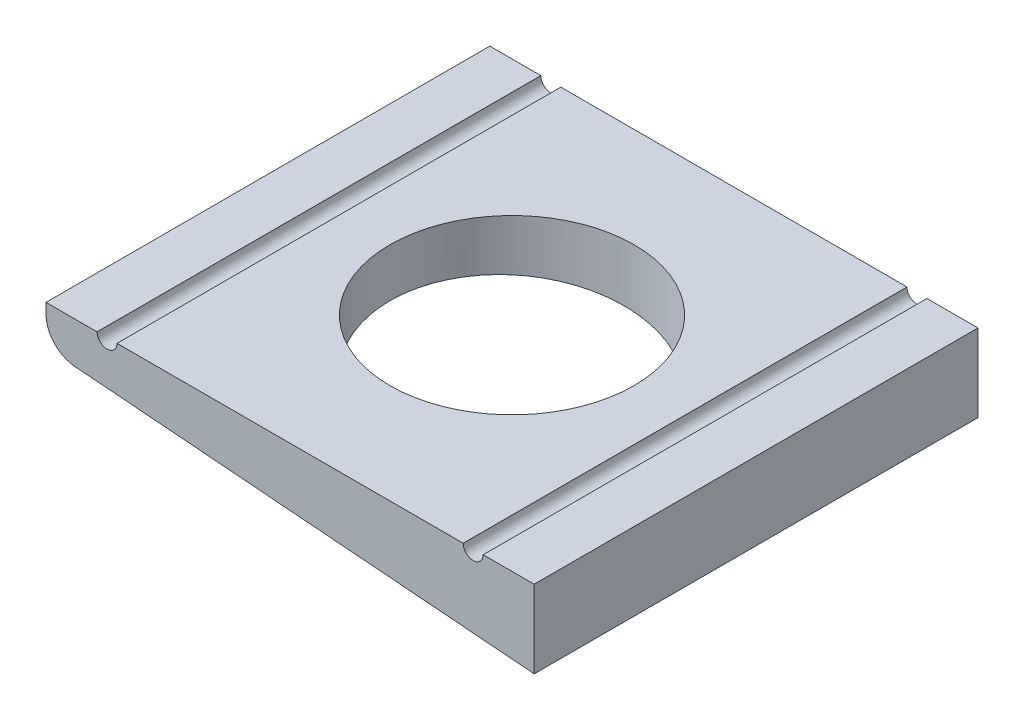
ISO-10303-21;
HEADER;
FILE_DESCRIPTION(('STEP AP214'),'2;1');
FILE_NAME('part.step','',(''),(''),'','','');
FILE_SCHEMA(('AUTOMOTIVE_DESIGN { 1 0 10303 214 1 1 1 1 }'));
ENDSEC;
DATA;
#1=APPLICATION_CONTEXT('core data for automotive mechanical design processes');
#2=APPLICATION_PROTOCOL_DEFINITION('international standard','automotive_design',2000,#1);
#3=PRODUCT_CONTEXT('',#1,'mechanical');
#4=PRODUCT('Part','Part','',(#3));
#5=PRODUCT_RELATED_PRODUCT_CATEGORY('part','',(#4));
#6=PRODUCT_DEFINITION_FORMATION('','',#4);
#7=PRODUCT_DEFINITION_CONTEXT('part definition',#1,'design');
#8=PRODUCT_DEFINITION('design','',#6,#7);
#9=PRODUCT_DEFINITION_SHAPE('','',#8);
#10=(LENGTH_UNIT() NAMED_UNIT(*) SI_UNIT(.MILLI.,.METRE.));
#11=(NAMED_UNIT(*) PLANE_ANGLE_UNIT() SI_UNIT($,.RADIAN.));
#12=(NAMED_UNIT(*) SI_UNIT($,.STERADIAN.) SOLID_ANGLE_UNIT());
#13=UNCERTAINTY_MEASURE_WITH_UNIT(LENGTH_MEASURE(1.E-05),#10,'distance_accuracy_value','');
#14=(GEOMETRIC_REPRESENTATION_CONTEXT(3) GLOBAL_UNCERTAINTY_ASSIGNED_CONTEXT((#13)) GLOBAL_UNIT_ASSIGNED_CONTEXT((#10,
#11,#12)) REPRESENTATION_CONTEXT('',''));
#15=CARTESIAN_POINT('',(0.,0.,0.));
#16=DIRECTION('',(0.,0.,1.));
#17=DIRECTION('',(1.,0.,0.));
#18=AXIS2_PLACEMENT_3D('',#15,#16,#17);
#19=CARTESIAN_POINT('',(22.,0.,20.));
#20=DIRECTION('',(0.,-1.,0.));
#21=DIRECTION('',(1.,0.,0.));
#22=AXIS2_PLACEMENT_3D('',#19,#20,#21);
#23=PLANE('',#22);
#24=CARTESIAN_POINT('',(0.,0.,0.));
#25=DIRECTION('',(0.,1.,0.));
#26=DIRECTION('',(-1.,0.,0.));
#27=AXIS2_PLACEMENT_3D('',#24,#25,#26);
#28=CIRCLE('',#27,11.);
#29=CARTESIAN_POINT('',(-11.,0.,0.));
#30=VERTEX_POINT('',#29);
#31=EDGE_CURVE('E155',#30,#30,#28,.T.);
#32=ORIENTED_EDGE('',*,*,#31,.F.);
#33=EDGE_LOOP('',(#32));
#34=FACE_BOUND('',#33,.T.);
#35=DIRECTION('',(-1.,0.,0.));
#36=VECTOR('',#35,1.);
#37=CARTESIAN_POINT('',(22.,0.,-20.));
#38=LINE('',#37,#36);
#39=CARTESIAN_POINT('',(15.6,0.,-20.));
#40=VERTEX_POINT('',#39);
#41=CARTESIAN_POINT('',(-15.6,0.,-20.));
#42=VERTEX_POINT('',#41);
#43=EDGE_CURVE('E121',#40,#42,#38,.T.);
#44=ORIENTED_EDGE('',*,*,#43,.T.);
#45=DIRECTION('',(0.,0.,1.));
#46=VECTOR('',#45,1.);
#47=CARTESIAN_POINT('',(-15.6,0.,-20.));
#48=LINE('',#47,#46);
#49=CARTESIAN_POINT('',(-15.6,0.,20.));
#50=VERTEX_POINT('',#49);
#51=EDGE_CURVE('E47',#42,#50,#48,.T.);
#52=ORIENTED_EDGE('',*,*,#51,.T.);
#53=DIRECTION('',(-1.,0.,0.));
#54=VECTOR('',#53,1.);
#55=CARTESIAN_POINT('',(22.,0.,20.));
#56=LINE('',#55,#54);
#57=CARTESIAN_POINT('',(15.6,0.,20.));
#58=VERTEX_POINT('',#57);
#59=EDGE_CURVE('E163',#58,#50,#56,.T.);
#60=ORIENTED_EDGE('',*,*,#59,.F.);
#61=DIRECTION('',(0.,0.,1.));
#62=VECTOR('',#61,1.);
#63=CARTESIAN_POINT('',(15.6,0.,-20.));
#64=LINE('',#63,#62);
#65=EDGE_CURVE('E158',#58,#40,#64,.F.);
#66=ORIENTED_EDGE('',*,*,#65,.T.);
#67=EDGE_LOOP('',(#44,#52,#60,#66));
#68=FACE_BOUND('',#67,.T.);
#69=ADVANCED_FACE('F33',(#34,#68),#23,.F.);
#70=CARTESIAN_POINT('',(22.,0.,-20.));
#71=VERTEX_POINT('',#70);
#72=CARTESIAN_POINT('',(17.4,0.,-20.));
#73=VERTEX_POINT('',#72);
#74=EDGE_CURVE('E124',#71,#73,#38,.T.);
#75=ORIENTED_EDGE('',*,*,#74,.T.);
#76=DIRECTION('',(0.,0.,1.));
#77=VECTOR('',#76,1.);
#78=CARTESIAN_POINT('',(17.4,0.,-20.));
#79=LINE('',#78,#77);
#80=CARTESIAN_POINT('',(17.4,0.,20.));
#81=VERTEX_POINT('',#80);
#82=EDGE_CURVE('E55',#73,#81,#79,.T.);
#83=ORIENTED_EDGE('',*,*,#82,.T.);
#84=CARTESIAN_POINT('',(22.,0.,20.));
#85=VERTEX_POINT('',#84);
#86=EDGE_CURVE('E174',#85,#81,#56,.T.);
#87=ORIENTED_EDGE('',*,*,#86,.F.);
#88=DIRECTION('',(0.,0.,-1.));
#89=VECTOR('',#88,1.);
#90=CARTESIAN_POINT('',(22.,0.,20.));
#91=LINE('',#90,#89);
#92=EDGE_CURVE('E152',#85,#71,#91,.T.);
#93=ORIENTED_EDGE('',*,*,#92,.T.);
#94=EDGE_LOOP('',(#75,#83,#87,#93));
#95=FACE_BOUND('',#94,.T.);
#96=ADVANCED_FACE('F194',(#95),#23,.F.);
#97=CARTESIAN_POINT('',(22.,0.,20.));
#98=DIRECTION('',(-1.,0.,0.));
#99=DIRECTION('',(0.,0.,1.));
#100=AXIS2_PLACEMENT_3D('',#97,#98,#99);
#101=PLANE('',#100);
#102=DIRECTION('',(0.,1.,0.));
#103=VECTOR('',#102,1.);
#104=CARTESIAN_POINT('',(22.,0.,-20.));
#105=LINE('',#104,#103);
#106=CARTESIAN_POINT('',(22.,-7.,-20.));
#107=VERTEX_POINT('',#106);
#108=EDGE_CURVE('E122',#107,#71,#105,.T.);
#109=ORIENTED_EDGE('',*,*,#108,.T.);
#110=ORIENTED_EDGE('',*,*,#92,.F.);
#111=DIRECTION('',(0.,1.,0.));
#112=VECTOR('',#111,1.);
#113=CARTESIAN_POINT('',(22.,0.,20.));
#114=LINE('',#113,#112);
#115=CARTESIAN_POINT('',(22.,-7.,20.));
#116=VERTEX_POINT('',#115);
#117=EDGE_CURVE('E140',#116,#85,#114,.T.);
#118=ORIENTED_EDGE('',*,*,#117,.F.);
#119=DIRECTION('',(0.,0.,-1.));
#120=VECTOR('',#119,1.);
#121=CARTESIAN_POINT('',(22.,-7.,20.));
#122=LINE('',#121,#120);
#123=EDGE_CURVE('E141',#116,#107,#122,.T.);
#124=ORIENTED_EDGE('',*,*,#123,.T.);
#125=EDGE_LOOP('',(#109,#110,#118,#124));
#126=FACE_BOUND('',#125,.T.);
#127=ADVANCED_FACE('F35',(#126),#101,.F.);
#128=CARTESIAN_POINT('',(-17.4,0.,20.));
#129=VERTEX_POINT('',#128);
#130=CARTESIAN_POINT('',(-22.,0.,20.));
#131=VERTEX_POINT('',#130);
#132=EDGE_CURVE('E114',#129,#131,#56,.T.);
#133=ORIENTED_EDGE('',*,*,#132,.F.);
#134=DIRECTION('',(0.,0.,1.));
#135=VECTOR('',#134,1.);
#136=CARTESIAN_POINT('',(-17.4,0.,-20.));
#137=LINE('',#136,#135);
#138=CARTESIAN_POINT('',(-17.4,0.,-20.));
#139=VERTEX_POINT('',#138);
#140=EDGE_CURVE('E102',#129,#139,#137,.F.);
#141=ORIENTED_EDGE('',*,*,#140,.T.);
#142=CARTESIAN_POINT('',(-22.,0.,-20.));
#143=VERTEX_POINT('',#142);
#144=EDGE_CURVE('E112',#139,#143,#38,.T.);
#145=ORIENTED_EDGE('',*,*,#144,.T.);
#146=DIRECTION('',(0.,0.,-1.));
#147=VECTOR('',#146,1.);
#148=CARTESIAN_POINT('',(-22.,0.,20.));
#149=LINE('',#148,#147);
#150=EDGE_CURVE('E150',#131,#143,#149,.T.);
#151=ORIENTED_EDGE('',*,*,#150,.F.);
#152=EDGE_LOOP('',(#133,#141,#145,#151));
#153=FACE_BOUND('',#152,.T.);
#154=ADVANCED_FACE('F110',(#153),#23,.F.);
#155=CARTESIAN_POINT('',(-22.,0.,20.));
#156=DIRECTION('',(1.,0.,0.));
#157=DIRECTION('',(0.,1.,0.));
#158=AXIS2_PLACEMENT_3D('',#155,#156,#157);
#159=PLANE('',#158);
#160=DIRECTION('',(0.,-1.,0.));
#161=VECTOR('',#160,1.);
#162=CARTESIAN_POINT('',(-22.,0.,-20.));
#163=LINE('',#162,#161);
#164=CARTESIAN_POINT('',(-22.,-0.913882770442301,-20.));
#165=VERTEX_POINT('',#164);
#166=EDGE_CURVE('E120',#143,#165,#163,.T.);
#167=ORIENTED_EDGE('',*,*,#166,.T.);
#168=DIRECTION('',(0.,0.,-1.));
#169=VECTOR('',#168,1.);
#170=CARTESIAN_POINT('',(-22.,-0.913882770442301,20.));
#171=LINE('',#170,#169);
#172=CARTESIAN_POINT('',(-22.,-0.913882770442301,20.));
#173=VERTEX_POINT('',#172);
#174=EDGE_CURVE('E148',#173,#165,#171,.T.);
#175=ORIENTED_EDGE('',*,*,#174,.F.);
#176=DIRECTION('',(0.,-1.,0.));
#177=VECTOR('',#176,1.);
#178=CARTESIAN_POINT('',(-22.,0.,20.));
#179=LINE('',#178,#177);
#180=EDGE_CURVE('E177',#131,#173,#179,.T.);
#181=ORIENTED_EDGE('',*,*,#180,.F.);
#182=ORIENTED_EDGE('',*,*,#150,.T.);
#183=EDGE_LOOP('',(#167,#175,#181,#182));
#184=FACE_BOUND('',#183,.T.);
#185=ADVANCED_FACE('F196',(#184),#159,.F.);
#186=CARTESIAN_POINT('',(-19.2,-0.9138827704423,20.));
#187=DIRECTION('',(0.,0.,-1.));
#188=DIRECTION('',(-1.,0.,0.));
#189=AXIS2_PLACEMENT_3D('',#186,#187,#188);
#190=CYLINDRICAL_SURFACE('',#189,2.8);
#191=CARTESIAN_POINT('',(-19.2,-0.9138827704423,-20.));
#192=DIRECTION('',(0.,0.,1.));
#193=DIRECTION('',(-1.,0.,0.));
#194=AXIS2_PLACEMENT_3D('',#191,#192,#193);
#195=CIRCLE('',#194,2.8);
#196=CARTESIAN_POINT('',(-19.4220259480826,-3.70506611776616,-20.));
#197=VERTEX_POINT('',#196);
#198=EDGE_CURVE('E132',#165,#197,#195,.T.);
#199=ORIENTED_EDGE('',*,*,#198,.T.);
#200=DIRECTION('',(0.,0.,-1.));
#201=VECTOR('',#200,1.);
#202=CARTESIAN_POINT('',(-19.4220259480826,-3.70506611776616,20.));
#203=LINE('',#202,#201);
#204=CARTESIAN_POINT('',(-19.4220259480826,-3.70506611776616,20.));
#205=VERTEX_POINT('',#204);
#206=EDGE_CURVE('E144',#205,#197,#203,.T.);
#207=ORIENTED_EDGE('',*,*,#206,.F.);
#208=CARTESIAN_POINT('',(-19.2,-0.9138827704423,20.));
#209=DIRECTION('',(0.,0.,1.));
#210=DIRECTION('',(-1.,0.,0.));
#211=AXIS2_PLACEMENT_3D('',#208,#209,#210);
#212=CIRCLE('',#211,2.8);
#213=EDGE_CURVE('E179',#173,#205,#212,.T.);
#214=ORIENTED_EDGE('',*,*,#213,.F.);
#215=ORIENTED_EDGE('',*,*,#174,.T.);
#216=EDGE_LOOP('',(#199,#207,#214,#215));
#217=FACE_BOUND('',#216,.T.);
#218=ADVANCED_FACE('F198',(#217),#190,.T.);
#219=CARTESIAN_POINT('',(22.,-7.,20.));
#220=DIRECTION('',(0.0792949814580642,0.996851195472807,0.));
#221=DIRECTION('',(-0.996851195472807,0.0792949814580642,0.));
#222=AXIS2_PLACEMENT_3D('',#219,#220,#221);
#223=PLANE('',#222);
#224=CARTESIAN_POINT('',(0.,-5.25,0.));
#225=DIRECTION('',(0.0792949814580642,0.996851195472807,0.));
#226=DIRECTION('',(-0.996851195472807,0.0792949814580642,0.));
#227=AXIS2_PLACEMENT_3D('',#224,#225,#226);
#228=ELLIPSE('',#227,11.0347462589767,11.);
#229=CARTESIAN_POINT('',(-11.,-4.375,0.));
#230=VERTEX_POINT('',#229);
#231=EDGE_CURVE('E126',#230,#230,#228,.T.);
#232=ORIENTED_EDGE('',*,*,#231,.T.);
#233=EDGE_LOOP('',(#232));
#234=FACE_BOUND('',#233,.T.);
#235=DIRECTION('',(0.996851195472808,-0.0792949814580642,0.));
#236=VECTOR('',#235,1.);
#237=CARTESIAN_POINT('',(22.,-7.,-20.));
#238=LINE('',#237,#236);
#239=EDGE_CURVE('E136',#197,#107,#238,.T.);
#240=ORIENTED_EDGE('',*,*,#239,.T.);
#241=ORIENTED_EDGE('',*,*,#123,.F.);
#242=DIRECTION('',(0.996851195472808,-0.0792949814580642,0.));
#243=VECTOR('',#242,1.);
#244=CARTESIAN_POINT('',(22.,-7.,20.));
#245=LINE('',#244,#243);
#246=EDGE_CURVE('E145',#205,#116,#245,.T.);
#247=ORIENTED_EDGE('',*,*,#246,.F.);
#248=ORIENTED_EDGE('',*,*,#206,.T.);
#249=EDGE_LOOP('',(#240,#241,#247,#248));
#250=FACE_BOUND('',#249,.T.);
#251=ADVANCED_FACE('F190',(#234,#250),#223,.F.);
#252=CARTESIAN_POINT('',(-19.2,-0.9138827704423,20.));
#253=DIRECTION('',(0.,0.,-1.));
#254=DIRECTION('',(-1.,0.,0.));
#255=AXIS2_PLACEMENT_3D('',#252,#253,#254);
#256=PLANE('',#255);
#257=ORIENTED_EDGE('',*,*,#59,.T.);
#258=CARTESIAN_POINT('',(-16.5,0.,20.));
#259=DIRECTION('',(0.,0.,1.));
#260=DIRECTION('',(1.,0.,0.));
#261=AXIS2_PLACEMENT_3D('',#258,#259,#260);
#262=CIRCLE('',#261,0.9);
#263=EDGE_CURVE('E115',#129,#50,#262,.T.);
#264=ORIENTED_EDGE('',*,*,#263,.F.);
#265=ORIENTED_EDGE('',*,*,#132,.T.);
#266=ORIENTED_EDGE('',*,*,#180,.T.);
#267=ORIENTED_EDGE('',*,*,#213,.T.);
#268=ORIENTED_EDGE('',*,*,#246,.T.);
#269=ORIENTED_EDGE('',*,*,#117,.T.);
#270=ORIENTED_EDGE('',*,*,#86,.T.);
#271=CARTESIAN_POINT('',(16.5,0.,20.));
#272=DIRECTION('',(0.,0.,1.));
#273=DIRECTION('',(1.,0.,0.));
#274=AXIS2_PLACEMENT_3D('',#271,#272,#273);
#275=CIRCLE('',#274,0.9);
#276=EDGE_CURVE('E164',#58,#81,#275,.T.);
#277=ORIENTED_EDGE('',*,*,#276,.F.);
#278=EDGE_LOOP('',(#257,#264,#265,#266,#267,#268,#269,#270,#277));
#279=FACE_BOUND('',#278,.T.);
#280=ADVANCED_FACE('F184',(#279),#256,.F.);
#281=CARTESIAN_POINT('',(-19.2,-0.9138827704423,-20.));
#282=DIRECTION('',(0.,0.,-1.));
#283=DIRECTION('',(-1.,0.,0.));
#284=AXIS2_PLACEMENT_3D('',#281,#282,#283);
#285=PLANE('',#284);
#286=CARTESIAN_POINT('',(-16.5,0.,-20.));
#287=DIRECTION('',(0.,0.,-1.));
#288=DIRECTION('',(-1.,0.,0.));
#289=AXIS2_PLACEMENT_3D('',#286,#287,#288);
#290=CIRCLE('',#289,0.9);
#291=EDGE_CURVE('E11',#42,#139,#290,.T.);
#292=ORIENTED_EDGE('',*,*,#291,.F.);
#293=ORIENTED_EDGE('',*,*,#43,.F.);
#294=CARTESIAN_POINT('',(16.5,0.,-20.));
#295=DIRECTION('',(0.,0.,-1.));
#296=DIRECTION('',(-1.,0.,0.));
#297=AXIS2_PLACEMENT_3D('',#294,#295,#296);
#298=CIRCLE('',#297,0.9);
#299=EDGE_CURVE('E41',#73,#40,#298,.T.);
#300=ORIENTED_EDGE('',*,*,#299,.F.);
#301=ORIENTED_EDGE('',*,*,#74,.F.);
#302=ORIENTED_EDGE('',*,*,#108,.F.);
#303=ORIENTED_EDGE('',*,*,#239,.F.);
#304=ORIENTED_EDGE('',*,*,#198,.F.);
#305=ORIENTED_EDGE('',*,*,#166,.F.);
#306=ORIENTED_EDGE('',*,*,#144,.F.);
#307=EDGE_LOOP('',(#292,#293,#300,#301,#302,#303,#304,#305,#306));
#308=FACE_BOUND('',#307,.T.);
#309=ADVANCED_FACE('F118',(#308),#285,.T.);
#310=CARTESIAN_POINT('',(0.,-7.,0.));
#311=DIRECTION('',(0.,1.,0.));
#312=DIRECTION('',(-1.,0.,0.));
#313=AXIS2_PLACEMENT_3D('',#310,#311,#312);
#314=CYLINDRICAL_SURFACE('',#313,11.);
#315=ORIENTED_EDGE('',*,*,#31,.T.);
#316=EDGE_LOOP('',(#315));
#317=FACE_BOUND('',#316,.T.);
#318=ORIENTED_EDGE('',*,*,#231,.F.);
#319=EDGE_LOOP('',(#318));
#320=FACE_BOUND('',#319,.T.);
#321=ADVANCED_FACE('F252',(#317,#320),#314,.F.);
#322=CARTESIAN_POINT('',(16.5,0.,-20.));
#323=DIRECTION('',(0.,0.,1.));
#324=DIRECTION('',(1.,0.,0.));
#325=AXIS2_PLACEMENT_3D('',#322,#323,#324);
#326=CYLINDRICAL_SURFACE('',#325,0.9);
#327=ORIENTED_EDGE('',*,*,#299,.T.);
#328=ORIENTED_EDGE('',*,*,#65,.F.);
#329=ORIENTED_EDGE('',*,*,#276,.T.);
#330=ORIENTED_EDGE('',*,*,#82,.F.);
#331=EDGE_LOOP('',(#327,#328,#329,#330));
#332=FACE_BOUND('',#331,.T.);
#333=ADVANCED_FACE('F157',(#332),#326,.F.);
#334=CARTESIAN_POINT('',(-16.5,0.,-20.));
#335=DIRECTION('',(0.,0.,1.));
#336=DIRECTION('',(1.,0.,0.));
#337=AXIS2_PLACEMENT_3D('',#334,#335,#336);
#338=CYLINDRICAL_SURFACE('',#337,0.9);
#339=ORIENTED_EDGE('',*,*,#291,.T.);
#340=ORIENTED_EDGE('',*,*,#140,.F.);
#341=ORIENTED_EDGE('',*,*,#263,.T.);
#342=ORIENTED_EDGE('',*,*,#51,.F.);
#343=EDGE_LOOP('',(#339,#340,#341,#342));
#344=FACE_BOUND('',#343,.T.);
#345=ADVANCED_FACE('F101',(#344),#338,.F.);
#346=CLOSED_SHELL('',(#69,#96,#127,#154,#185,#218,#251,#280,#309,#321,#333,#345));
#347=MANIFOLD_SOLID_BREP('B2',#346);
#348=ADVANCED_BREP_SHAPE_REPRESENTATION('',(#18,#347),#14);
#349=SHAPE_DEFINITION_REPRESENTATION(#9,#348);
ENDSEC;
END-ISO-10303-21;
